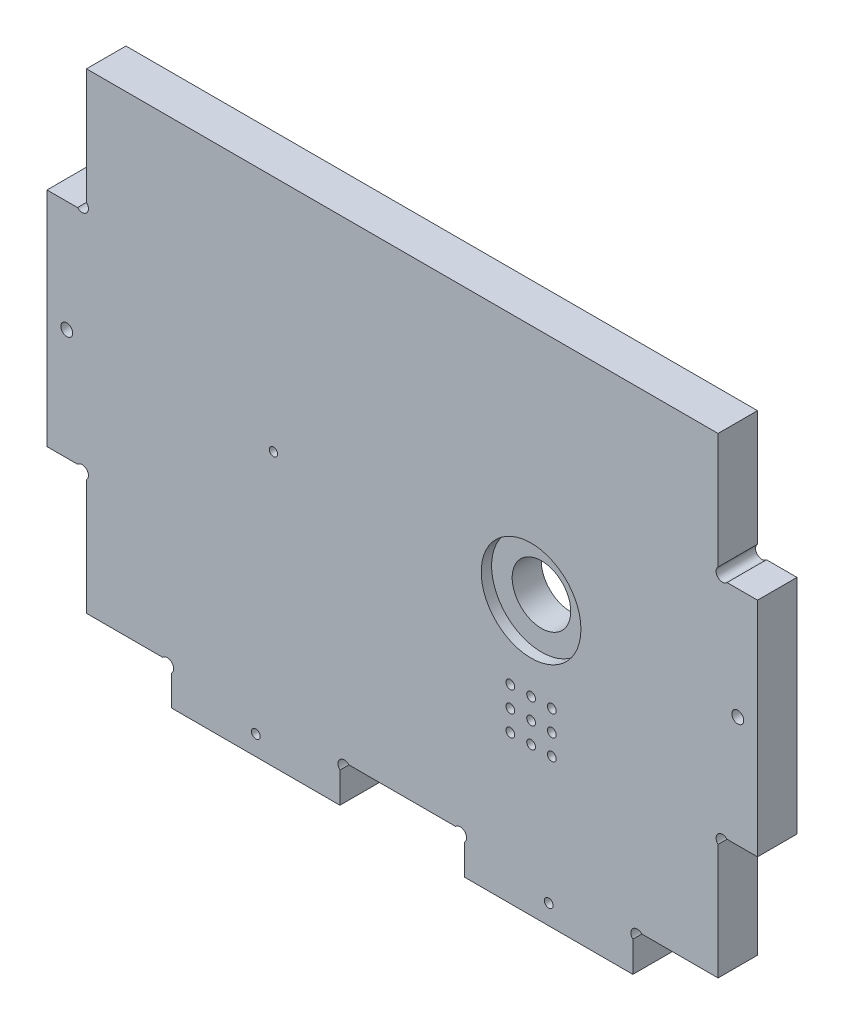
ISO-10303-21;
HEADER;
FILE_DESCRIPTION(('STEP AP214'),'2;1');
FILE_NAME('part.step','',(''),(''),'','','');
FILE_SCHEMA(('AUTOMOTIVE_DESIGN { 1 0 10303 214 1 1 1 1 }'));
ENDSEC;
DATA;
#1=APPLICATION_CONTEXT('core data for automotive mechanical design processes');
#2=APPLICATION_PROTOCOL_DEFINITION('international standard','automotive_design',2000,#1);
#3=PRODUCT_CONTEXT('',#1,'mechanical');
#4=PRODUCT('Part','Part','',(#3));
#5=PRODUCT_RELATED_PRODUCT_CATEGORY('part','',(#4));
#6=PRODUCT_DEFINITION_FORMATION('','',#4);
#7=PRODUCT_DEFINITION_CONTEXT('part definition',#1,'design');
#8=PRODUCT_DEFINITION('design','',#6,#7);
#9=PRODUCT_DEFINITION_SHAPE('','',#8);
#10=(LENGTH_UNIT() NAMED_UNIT(*) SI_UNIT(.MILLI.,.METRE.));
#11=(NAMED_UNIT(*) PLANE_ANGLE_UNIT() SI_UNIT($,.RADIAN.));
#12=(NAMED_UNIT(*) SI_UNIT($,.STERADIAN.) SOLID_ANGLE_UNIT());
#13=UNCERTAINTY_MEASURE_WITH_UNIT(LENGTH_MEASURE(1.E-05),#10,'distance_accuracy_value','');
#14=(GEOMETRIC_REPRESENTATION_CONTEXT(3) GLOBAL_UNCERTAINTY_ASSIGNED_CONTEXT((#13)) GLOBAL_UNIT_ASSIGNED_CONTEXT((#10,
#11,#12)) REPRESENTATION_CONTEXT('',''));
#15=CARTESIAN_POINT('',(0.,0.,0.));
#16=DIRECTION('',(0.,0.,1.));
#17=DIRECTION('',(1.,0.,0.));
#18=AXIS2_PLACEMENT_3D('',#15,#16,#17);
#19=CARTESIAN_POINT('',(62.,131.327177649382,0.));
#20=DIRECTION('',(0.,0.,1.));
#21=DIRECTION('',(1.,0.,0.));
#22=AXIS2_PLACEMENT_3D('',#19,#20,#21);
#23=CYLINDRICAL_SURFACE('',#22,14.1);
#24=CARTESIAN_POINT('',(62.,131.327177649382,0.));
#25=DIRECTION('',(0.,0.,1.));
#26=DIRECTION('',(1.,0.,0.));
#27=AXIS2_PLACEMENT_3D('',#24,#25,#26);
#28=CIRCLE('',#27,14.1);
#29=CARTESIAN_POINT('',(76.1,131.327177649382,0.));
#30=VERTEX_POINT('',#29);
#31=EDGE_CURVE('E542',#30,#30,#28,.T.);
#32=ORIENTED_EDGE('',*,*,#31,.F.);
#33=EDGE_LOOP('',(#32));
#34=FACE_BOUND('',#33,.T.);
#35=CARTESIAN_POINT('',(62.,131.327177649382,14.));
#36=DIRECTION('',(0.,0.,1.));
#37=DIRECTION('',(1.,0.,0.));
#38=AXIS2_PLACEMENT_3D('',#35,#36,#37);
#39=CIRCLE('',#38,14.1);
#40=CARTESIAN_POINT('',(76.1,131.327177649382,14.));
#41=VERTEX_POINT('',#40);
#42=EDGE_CURVE('E38',#41,#41,#39,.F.);
#43=ORIENTED_EDGE('',*,*,#42,.F.);
#44=EDGE_LOOP('',(#43));
#45=FACE_BOUND('',#44,.T.);
#46=ADVANCED_FACE('F34',(#34,#45),#23,.F.);
#47=CARTESIAN_POINT('',(113.1,16.9,19.));
#48=DIRECTION('',(0.,0.,1.));
#49=DIRECTION('',(1.,0.,0.));
#50=AXIS2_PLACEMENT_3D('',#47,#48,#49);
#51=PLANE('',#50);
#52=CARTESIAN_POINT('',(62.,131.327177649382,19.));
#53=DIRECTION('',(0.,0.,1.));
#54=DIRECTION('',(1.,0.,0.));
#55=AXIS2_PLACEMENT_3D('',#52,#53,#54);
#56=CIRCLE('',#55,24.);
#57=CARTESIAN_POINT('',(86.,131.327177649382,19.));
#58=VERTEX_POINT('',#57);
#59=EDGE_CURVE('E614',#58,#58,#56,.T.);
#60=ORIENTED_EDGE('',*,*,#59,.F.);
#61=EDGE_LOOP('',(#60));
#62=FACE_BOUND('',#61,.T.);
#63=CARTESIAN_POINT('',(62.,71.3271776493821,19.));
#64=DIRECTION('',(0.,0.,1.));
#65=DIRECTION('',(-1.,0.,0.));
#66=AXIS2_PLACEMENT_3D('',#63,#64,#65);
#67=CIRCLE('',#66,2.09999999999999);
#68=CARTESIAN_POINT('',(59.9,71.3271776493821,19.));
#69=VERTEX_POINT('',#68);
#70=EDGE_CURVE('E610',#69,#69,#67,.T.);
#71=ORIENTED_EDGE('',*,*,#70,.F.);
#72=EDGE_LOOP('',(#71));
#73=FACE_BOUND('',#72,.T.);
#74=CARTESIAN_POINT('',(52.0000000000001,71.3271776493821,19.));
#75=DIRECTION('',(0.,0.,1.));
#76=DIRECTION('',(1.,0.,0.));
#77=AXIS2_PLACEMENT_3D('',#74,#75,#76);
#78=CIRCLE('',#77,2.1);
#79=CARTESIAN_POINT('',(54.1000000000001,71.3271776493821,19.));
#80=VERTEX_POINT('',#79);
#81=EDGE_CURVE('E606',#80,#80,#78,.T.);
#82=ORIENTED_EDGE('',*,*,#81,.F.);
#83=EDGE_LOOP('',(#82));
#84=FACE_BOUND('',#83,.T.);
#85=CARTESIAN_POINT('',(72.,71.3271776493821,19.));
#86=DIRECTION('',(0.,0.,1.));
#87=DIRECTION('',(-1.,0.,0.));
#88=AXIS2_PLACEMENT_3D('',#85,#86,#87);
#89=CIRCLE('',#88,2.1);
#90=CARTESIAN_POINT('',(69.9,71.3271776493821,19.));
#91=VERTEX_POINT('',#90);
#92=EDGE_CURVE('E602',#91,#91,#89,.T.);
#93=ORIENTED_EDGE('',*,*,#92,.F.);
#94=EDGE_LOOP('',(#93));
#95=FACE_BOUND('',#94,.T.);
#96=CARTESIAN_POINT('',(52.,81.3271776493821,19.));
#97=DIRECTION('',(0.,0.,1.));
#98=DIRECTION('',(-1.,0.,0.));
#99=AXIS2_PLACEMENT_3D('',#96,#97,#98);
#100=CIRCLE('',#99,2.09999999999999);
#101=CARTESIAN_POINT('',(49.9000000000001,81.3271776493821,19.));
#102=VERTEX_POINT('',#101);
#103=EDGE_CURVE('E598',#102,#102,#100,.T.);
#104=ORIENTED_EDGE('',*,*,#103,.F.);
#105=EDGE_LOOP('',(#104));
#106=FACE_BOUND('',#105,.T.);
#107=CARTESIAN_POINT('',(72.,91.3271776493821,19.));
#108=DIRECTION('',(0.,0.,1.));
#109=DIRECTION('',(1.,0.,0.));
#110=AXIS2_PLACEMENT_3D('',#107,#108,#109);
#111=CIRCLE('',#110,2.1);
#112=CARTESIAN_POINT('',(74.1,91.3271776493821,19.));
#113=VERTEX_POINT('',#112);
#114=EDGE_CURVE('E594',#113,#113,#111,.T.);
#115=ORIENTED_EDGE('',*,*,#114,.F.);
#116=EDGE_LOOP('',(#115));
#117=FACE_BOUND('',#116,.T.);
#118=CARTESIAN_POINT('',(62.,91.3271776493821,19.));
#119=DIRECTION('',(0.,0.,1.));
#120=DIRECTION('',(1.,0.,0.));
#121=AXIS2_PLACEMENT_3D('',#118,#119,#120);
#122=CIRCLE('',#121,2.09999999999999);
#123=CARTESIAN_POINT('',(64.1,91.3271776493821,19.));
#124=VERTEX_POINT('',#123);
#125=EDGE_CURVE('E590',#124,#124,#122,.T.);
#126=ORIENTED_EDGE('',*,*,#125,.F.);
#127=EDGE_LOOP('',(#126));
#128=FACE_BOUND('',#127,.T.);
#129=CARTESIAN_POINT('',(72.0000000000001,81.3271776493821,19.));
#130=DIRECTION('',(0.,0.,1.));
#131=DIRECTION('',(1.,0.,0.));
#132=AXIS2_PLACEMENT_3D('',#129,#130,#131);
#133=CIRCLE('',#132,2.09999999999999);
#134=CARTESIAN_POINT('',(74.1,81.3271776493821,19.));
#135=VERTEX_POINT('',#134);
#136=EDGE_CURVE('E586',#135,#135,#133,.T.);
#137=ORIENTED_EDGE('',*,*,#136,.F.);
#138=EDGE_LOOP('',(#137));
#139=FACE_BOUND('',#138,.T.);
#140=CARTESIAN_POINT('',(52.0000000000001,91.3271776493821,19.));
#141=DIRECTION('',(0.,0.,1.));
#142=DIRECTION('',(-1.,0.,0.));
#143=AXIS2_PLACEMENT_3D('',#140,#141,#142);
#144=CIRCLE('',#143,2.1);
#145=CARTESIAN_POINT('',(49.9000000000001,91.3271776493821,19.));
#146=VERTEX_POINT('',#145);
#147=EDGE_CURVE('E582',#146,#146,#144,.T.);
#148=ORIENTED_EDGE('',*,*,#147,.F.);
#149=EDGE_LOOP('',(#148));
#150=FACE_BOUND('',#149,.T.);
#151=CARTESIAN_POINT('',(62.,81.3271776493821,19.));
#152=DIRECTION('',(0.,0.,1.));
#153=DIRECTION('',(1.,0.,0.));
#154=AXIS2_PLACEMENT_3D('',#151,#152,#153);
#155=CIRCLE('',#154,2.1);
#156=CARTESIAN_POINT('',(64.1000000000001,81.3271776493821,19.));
#157=VERTEX_POINT('',#156);
#158=EDGE_CURVE('E578',#157,#157,#155,.T.);
#159=ORIENTED_EDGE('',*,*,#158,.F.);
#160=EDGE_LOOP('',(#159));
#161=FACE_BOUND('',#160,.T.);
#162=CARTESIAN_POINT('',(-62.,131.327177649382,19.));
#163=DIRECTION('',(0.,0.,1.));
#164=DIRECTION('',(1.,0.,0.));
#165=AXIS2_PLACEMENT_3D('',#162,#163,#164);
#166=CIRCLE('',#165,2.);
#167=CARTESIAN_POINT('',(-60.,131.327177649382,19.));
#168=VERTEX_POINT('',#167);
#169=EDGE_CURVE('E574',#168,#168,#166,.T.);
#170=ORIENTED_EDGE('',*,*,#169,.F.);
#171=EDGE_LOOP('',(#170));
#172=FACE_BOUND('',#171,.T.);
#173=CARTESIAN_POINT('',(70.5,9.49999999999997,19.));
#174=DIRECTION('',(0.,0.,1.));
#175=DIRECTION('',(1.,0.,0.));
#176=AXIS2_PLACEMENT_3D('',#173,#174,#175);
#177=CIRCLE('',#176,2.1);
#178=CARTESIAN_POINT('',(72.6,9.49999999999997,19.));
#179=VERTEX_POINT('',#178);
#180=EDGE_CURVE('E562',#179,#179,#177,.T.);
#181=ORIENTED_EDGE('',*,*,#180,.F.);
#182=EDGE_LOOP('',(#181));
#183=FACE_BOUND('',#182,.T.);
#184=CARTESIAN_POINT('',(161.5,132.5,19.));
#185=DIRECTION('',(0.,0.,1.));
#186=DIRECTION('',(1.,0.,0.));
#187=AXIS2_PLACEMENT_3D('',#184,#185,#186);
#188=CIRCLE('',#187,2.86686344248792);
#189=CARTESIAN_POINT('',(164.366863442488,132.5,19.));
#190=VERTEX_POINT('',#189);
#191=EDGE_CURVE('E257',#190,#190,#188,.T.);
#192=ORIENTED_EDGE('',*,*,#191,.F.);
#193=EDGE_LOOP('',(#192));
#194=FACE_BOUND('',#193,.T.);
#195=DIRECTION('',(1.,0.,0.));
#196=VECTOR('',#195,1.);
#197=CARTESIAN_POINT('',(30.,0.,19.));
#198=LINE('',#197,#196);
#199=CARTESIAN_POINT('',(30.,0.,19.));
#200=VERTEX_POINT('',#199);
#201=CARTESIAN_POINT('',(111.,0.,19.));
#202=VERTEX_POINT('',#201);
#203=EDGE_CURVE('E308',#200,#202,#198,.T.);
#204=ORIENTED_EDGE('',*,*,#203,.T.);
#205=DIRECTION('',(0.,1.,0.));
#206=VECTOR('',#205,1.);
#207=CARTESIAN_POINT('',(111.,14.6881003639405,19.));
#208=LINE('',#207,#206);
#209=CARTESIAN_POINT('',(111.,14.6881003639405,19.));
#210=VERTEX_POINT('',#209);
#211=EDGE_CURVE('E155',#202,#210,#208,.T.);
#212=ORIENTED_EDGE('',*,*,#211,.T.);
#213=CARTESIAN_POINT('',(113.1,16.9,19.));
#214=DIRECTION('',(0.,0.,-1.));
#215=DIRECTION('',(1.,0.,0.));
#216=AXIS2_PLACEMENT_3D('',#213,#214,#215);
#217=CIRCLE('',#216,3.04999999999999);
#218=CARTESIAN_POINT('',(115.311899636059,19.,19.));
#219=VERTEX_POINT('',#218);
#220=EDGE_CURVE('E384',#210,#219,#217,.T.);
#221=ORIENTED_EDGE('',*,*,#220,.T.);
#222=DIRECTION('',(1.,0.,0.));
#223=VECTOR('',#222,1.);
#224=CARTESIAN_POINT('',(115.311899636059,19.,19.));
#225=LINE('',#224,#223);
#226=CARTESIAN_POINT('',(152.,19.,19.));
#227=VERTEX_POINT('',#226);
#228=EDGE_CURVE('E403',#219,#227,#225,.T.);
#229=ORIENTED_EDGE('',*,*,#228,.T.);
#230=DIRECTION('',(0.,1.,0.));
#231=VECTOR('',#230,1.);
#232=CARTESIAN_POINT('',(152.,74.6881003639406,19.));
#233=LINE('',#232,#231);
#234=CARTESIAN_POINT('',(152.,74.6881003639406,19.));
#235=VERTEX_POINT('',#234);
#236=EDGE_CURVE('E400',#227,#235,#233,.T.);
#237=ORIENTED_EDGE('',*,*,#236,.T.);
#238=CARTESIAN_POINT('',(154.1,76.9,19.));
#239=DIRECTION('',(0.,0.,-1.));
#240=DIRECTION('',(1.,0.,0.));
#241=AXIS2_PLACEMENT_3D('',#238,#239,#240);
#242=CIRCLE('',#241,3.04999999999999);
#243=CARTESIAN_POINT('',(156.311899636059,79.,19.));
#244=VERTEX_POINT('',#243);
#245=EDGE_CURVE('E402',#235,#244,#242,.T.);
#246=ORIENTED_EDGE('',*,*,#245,.T.);
#247=DIRECTION('',(1.,0.,0.));
#248=VECTOR('',#247,1.);
#249=CARTESIAN_POINT('',(171.,79.,19.));
#250=LINE('',#249,#248);
#251=CARTESIAN_POINT('',(171.,79.,19.));
#252=VERTEX_POINT('',#251);
#253=EDGE_CURVE('E405',#244,#252,#250,.T.);
#254=ORIENTED_EDGE('',*,*,#253,.T.);
#255=DIRECTION('',(0.,1.,0.));
#256=VECTOR('',#255,1.);
#257=CARTESIAN_POINT('',(171.,79.,19.));
#258=LINE('',#257,#256);
#259=CARTESIAN_POINT('',(171.,186.,19.));
#260=VERTEX_POINT('',#259);
#261=EDGE_CURVE('E411',#252,#260,#258,.T.);
#262=ORIENTED_EDGE('',*,*,#261,.T.);
#263=DIRECTION('',(-1.,0.,0.));
#264=VECTOR('',#263,1.);
#265=CARTESIAN_POINT('',(156.311899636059,186.,19.));
#266=LINE('',#265,#264);
#267=CARTESIAN_POINT('',(156.311899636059,186.,19.));
#268=VERTEX_POINT('',#267);
#269=EDGE_CURVE('E413',#260,#268,#266,.T.);
#270=ORIENTED_EDGE('',*,*,#269,.T.);
#271=CARTESIAN_POINT('',(154.1,188.1,19.));
#272=DIRECTION('',(0.,0.,-1.));
#273=DIRECTION('',(1.,0.,0.));
#274=AXIS2_PLACEMENT_3D('',#271,#272,#273);
#275=CIRCLE('',#274,3.05);
#276=CARTESIAN_POINT('',(152.,190.311899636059,19.));
#277=VERTEX_POINT('',#276);
#278=EDGE_CURVE('E415',#268,#277,#275,.T.);
#279=ORIENTED_EDGE('',*,*,#278,.T.);
#280=DIRECTION('',(0.,1.,0.));
#281=VECTOR('',#280,1.);
#282=CARTESIAN_POINT('',(152.,246.,19.));
#283=LINE('',#282,#281);
#284=CARTESIAN_POINT('',(152.,246.,19.));
#285=VERTEX_POINT('',#284);
#286=EDGE_CURVE('E417',#277,#285,#283,.T.);
#287=ORIENTED_EDGE('',*,*,#286,.T.);
#288=DIRECTION('',(-1.,0.,0.));
#289=VECTOR('',#288,1.);
#290=CARTESIAN_POINT('',(-152.,246.,19.));
#291=LINE('',#290,#289);
#292=CARTESIAN_POINT('',(-152.,246.,19.));
#293=VERTEX_POINT('',#292);
#294=EDGE_CURVE('E419',#285,#293,#291,.T.);
#295=ORIENTED_EDGE('',*,*,#294,.T.);
#296=DIRECTION('',(0.,-1.,0.));
#297=VECTOR('',#296,1.);
#298=CARTESIAN_POINT('',(-152.,246.,19.));
#299=LINE('',#298,#297);
#300=CARTESIAN_POINT('',(-152.,190.311899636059,19.));
#301=VERTEX_POINT('',#300);
#302=EDGE_CURVE('E421',#293,#301,#299,.T.);
#303=ORIENTED_EDGE('',*,*,#302,.T.);
#304=CARTESIAN_POINT('',(-154.1,188.1,19.));
#305=DIRECTION('',(0.,0.,-1.));
#306=DIRECTION('',(-1.,0.,0.));
#307=AXIS2_PLACEMENT_3D('',#304,#305,#306);
#308=CIRCLE('',#307,3.05);
#309=CARTESIAN_POINT('',(-156.311899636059,186.,19.));
#310=VERTEX_POINT('',#309);
#311=EDGE_CURVE('E423',#301,#310,#308,.T.);
#312=ORIENTED_EDGE('',*,*,#311,.T.);
#313=DIRECTION('',(-1.,0.,0.));
#314=VECTOR('',#313,1.);
#315=CARTESIAN_POINT('',(-156.311899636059,186.,19.));
#316=LINE('',#315,#314);
#317=CARTESIAN_POINT('',(-171.,186.,19.));
#318=VERTEX_POINT('',#317);
#319=EDGE_CURVE('E425',#310,#318,#316,.T.);
#320=ORIENTED_EDGE('',*,*,#319,.T.);
#321=DIRECTION('',(0.,-1.,0.));
#322=VECTOR('',#321,1.);
#323=CARTESIAN_POINT('',(-171.,186.,19.));
#324=LINE('',#323,#322);
#325=CARTESIAN_POINT('',(-171.,79.,19.));
#326=VERTEX_POINT('',#325);
#327=EDGE_CURVE('E427',#318,#326,#324,.T.);
#328=ORIENTED_EDGE('',*,*,#327,.T.);
#329=DIRECTION('',(1.,0.,0.));
#330=VECTOR('',#329,1.);
#331=CARTESIAN_POINT('',(-171.,79.,19.));
#332=LINE('',#331,#330);
#333=CARTESIAN_POINT('',(-156.311899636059,79.,19.));
#334=VERTEX_POINT('',#333);
#335=EDGE_CURVE('E429',#326,#334,#332,.T.);
#336=ORIENTED_EDGE('',*,*,#335,.T.);
#337=CARTESIAN_POINT('',(-154.1,76.9,19.));
#338=DIRECTION('',(0.,0.,-1.));
#339=DIRECTION('',(-1.,0.,0.));
#340=AXIS2_PLACEMENT_3D('',#337,#338,#339);
#341=CIRCLE('',#340,3.04999999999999);
#342=CARTESIAN_POINT('',(-152.,74.6881003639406,19.));
#343=VERTEX_POINT('',#342);
#344=EDGE_CURVE('E431',#334,#343,#341,.T.);
#345=ORIENTED_EDGE('',*,*,#344,.T.);
#346=DIRECTION('',(0.,-1.,0.));
#347=VECTOR('',#346,1.);
#348=CARTESIAN_POINT('',(-152.,74.6881003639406,19.));
#349=LINE('',#348,#347);
#350=CARTESIAN_POINT('',(-152.,19.,19.));
#351=VERTEX_POINT('',#350);
#352=EDGE_CURVE('E433',#343,#351,#349,.T.);
#353=ORIENTED_EDGE('',*,*,#352,.T.);
#354=DIRECTION('',(1.,0.,0.));
#355=VECTOR('',#354,1.);
#356=CARTESIAN_POINT('',(-115.311899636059,19.,19.));
#357=LINE('',#356,#355);
#358=CARTESIAN_POINT('',(-115.311899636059,19.,19.));
#359=VERTEX_POINT('',#358);
#360=EDGE_CURVE('E435',#351,#359,#357,.T.);
#361=ORIENTED_EDGE('',*,*,#360,.T.);
#362=CARTESIAN_POINT('',(-113.1,16.9,19.));
#363=DIRECTION('',(0.,0.,-1.));
#364=DIRECTION('',(-1.,0.,0.));
#365=AXIS2_PLACEMENT_3D('',#362,#363,#364);
#366=CIRCLE('',#365,3.04999999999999);
#367=CARTESIAN_POINT('',(-111.,14.6881003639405,19.));
#368=VERTEX_POINT('',#367);
#369=EDGE_CURVE('E437',#359,#368,#366,.T.);
#370=ORIENTED_EDGE('',*,*,#369,.T.);
#371=DIRECTION('',(0.,-1.,0.));
#372=VECTOR('',#371,1.);
#373=CARTESIAN_POINT('',(-111.,14.6881003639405,19.));
#374=LINE('',#373,#372);
#375=CARTESIAN_POINT('',(-111.,0.,19.));
#376=VERTEX_POINT('',#375);
#377=EDGE_CURVE('E439',#368,#376,#374,.T.);
#378=ORIENTED_EDGE('',*,*,#377,.T.);
#379=DIRECTION('',(1.,0.,0.));
#380=VECTOR('',#379,1.);
#381=CARTESIAN_POINT('',(-30.,0.,19.));
#382=LINE('',#381,#380);
#383=CARTESIAN_POINT('',(-30.,0.,19.));
#384=VERTEX_POINT('',#383);
#385=EDGE_CURVE('E441',#376,#384,#382,.T.);
#386=ORIENTED_EDGE('',*,*,#385,.T.);
#387=DIRECTION('',(0.,1.,0.));
#388=VECTOR('',#387,1.);
#389=CARTESIAN_POINT('',(-30.,0.,19.));
#390=LINE('',#389,#388);
#391=CARTESIAN_POINT('',(-30.,14.6881003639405,19.));
#392=VERTEX_POINT('',#391);
#393=EDGE_CURVE('E443',#384,#392,#390,.T.);
#394=ORIENTED_EDGE('',*,*,#393,.T.);
#395=CARTESIAN_POINT('',(-27.9,16.9,19.));
#396=DIRECTION('',(0.,0.,-1.));
#397=DIRECTION('',(-1.,0.,0.));
#398=AXIS2_PLACEMENT_3D('',#395,#396,#397);
#399=CIRCLE('',#398,3.05);
#400=CARTESIAN_POINT('',(-25.6881003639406,19.,19.));
#401=VERTEX_POINT('',#400);
#402=EDGE_CURVE('E235',#392,#401,#399,.T.);
#403=ORIENTED_EDGE('',*,*,#402,.T.);
#404=DIRECTION('',(1.,0.,0.));
#405=VECTOR('',#404,1.);
#406=CARTESIAN_POINT('',(25.6881003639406,19.,19.));
#407=LINE('',#406,#405);
#408=CARTESIAN_POINT('',(25.6881003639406,19.,19.));
#409=VERTEX_POINT('',#408);
#410=EDGE_CURVE('E228',#401,#409,#407,.T.);
#411=ORIENTED_EDGE('',*,*,#410,.T.);
#412=CARTESIAN_POINT('',(27.9,16.9,19.));
#413=DIRECTION('',(0.,0.,-1.));
#414=DIRECTION('',(1.,0.,0.));
#415=AXIS2_PLACEMENT_3D('',#412,#413,#414);
#416=CIRCLE('',#415,3.05);
#417=CARTESIAN_POINT('',(30.,14.6881003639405,19.));
#418=VERTEX_POINT('',#417);
#419=EDGE_CURVE('E233',#409,#418,#416,.T.);
#420=ORIENTED_EDGE('',*,*,#419,.T.);
#421=DIRECTION('',(0.,-1.,0.));
#422=VECTOR('',#421,1.);
#423=CARTESIAN_POINT('',(30.,0.,19.));
#424=LINE('',#423,#422);
#425=EDGE_CURVE('E52',#418,#200,#424,.T.);
#426=ORIENTED_EDGE('',*,*,#425,.T.);
#427=EDGE_LOOP('',(#204,#212,#221,#229,#237,#246,#254,#262,#270,#279,#287,#295,#303,#312,#320,
#328,#336,#345,#353,#361,#370,#378,#386,#394,#403,#411,#420,#426));
#428=FACE_BOUND('',#427,.T.);
#429=CARTESIAN_POINT('',(-161.5,132.5,19.));
#430=DIRECTION('',(0.,0.,1.));
#431=DIRECTION('',(-1.,0.,0.));
#432=AXIS2_PLACEMENT_3D('',#429,#430,#431);
#433=CIRCLE('',#432,2.86686344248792);
#434=CARTESIAN_POINT('',(-164.366863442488,132.5,19.));
#435=VERTEX_POINT('',#434);
#436=EDGE_CURVE('E551',#435,#435,#433,.T.);
#437=ORIENTED_EDGE('',*,*,#436,.F.);
#438=EDGE_LOOP('',(#437));
#439=FACE_BOUND('',#438,.T.);
#440=CARTESIAN_POINT('',(-70.5,9.49999999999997,19.));
#441=DIRECTION('',(0.,0.,1.));
#442=DIRECTION('',(-1.,0.,0.));
#443=AXIS2_PLACEMENT_3D('',#440,#441,#442);
#444=CIRCLE('',#443,2.1);
#445=CARTESIAN_POINT('',(-72.6,9.49999999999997,19.));
#446=VERTEX_POINT('',#445);
#447=EDGE_CURVE('E565',#446,#446,#444,.T.);
#448=ORIENTED_EDGE('',*,*,#447,.F.);
#449=EDGE_LOOP('',(#448));
#450=FACE_BOUND('',#449,.T.);
#451=ADVANCED_FACE('F230',(#62,#73,#84,#95,#106,#117,#128,#139,#150,#161,#172,#183,#194,#428,
#439,#450),#51,.T.);
#452=CARTESIAN_POINT('',(113.1,16.9,0.));
#453=DIRECTION('',(0.,0.,1.));
#454=DIRECTION('',(1.,0.,0.));
#455=AXIS2_PLACEMENT_3D('',#452,#453,#454);
#456=PLANE('',#455);
#457=CARTESIAN_POINT('',(62.,71.3271776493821,0.));
#458=DIRECTION('',(0.,0.,1.));
#459=DIRECTION('',(-1.,0.,0.));
#460=AXIS2_PLACEMENT_3D('',#457,#458,#459);
#461=CIRCLE('',#460,2.09999999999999);
#462=CARTESIAN_POINT('',(59.9,71.3271776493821,0.));
#463=VERTEX_POINT('',#462);
#464=EDGE_CURVE('E503',#463,#463,#461,.T.);
#465=ORIENTED_EDGE('',*,*,#464,.T.);
#466=EDGE_LOOP('',(#465));
#467=FACE_BOUND('',#466,.T.);
#468=CARTESIAN_POINT('',(52.0000000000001,71.3271776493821,0.));
#469=DIRECTION('',(0.,0.,1.));
#470=DIRECTION('',(1.,0.,0.));
#471=AXIS2_PLACEMENT_3D('',#468,#469,#470);
#472=CIRCLE('',#471,2.1);
#473=CARTESIAN_POINT('',(54.1000000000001,71.3271776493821,0.));
#474=VERTEX_POINT('',#473);
#475=EDGE_CURVE('E507',#474,#474,#472,.T.);
#476=ORIENTED_EDGE('',*,*,#475,.T.);
#477=EDGE_LOOP('',(#476));
#478=FACE_BOUND('',#477,.T.);
#479=CARTESIAN_POINT('',(72.,71.3271776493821,0.));
#480=DIRECTION('',(0.,0.,1.));
#481=DIRECTION('',(-1.,0.,0.));
#482=AXIS2_PLACEMENT_3D('',#479,#480,#481);
#483=CIRCLE('',#482,2.1);
#484=CARTESIAN_POINT('',(69.9,71.3271776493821,0.));
#485=VERTEX_POINT('',#484);
#486=EDGE_CURVE('E511',#485,#485,#483,.T.);
#487=ORIENTED_EDGE('',*,*,#486,.T.);
#488=EDGE_LOOP('',(#487));
#489=FACE_BOUND('',#488,.T.);
#490=CARTESIAN_POINT('',(52.,81.3271776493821,0.));
#491=DIRECTION('',(0.,0.,1.));
#492=DIRECTION('',(-1.,0.,0.));
#493=AXIS2_PLACEMENT_3D('',#490,#491,#492);
#494=CIRCLE('',#493,2.09999999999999);
#495=CARTESIAN_POINT('',(49.9000000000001,81.3271776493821,0.));
#496=VERTEX_POINT('',#495);
#497=EDGE_CURVE('E515',#496,#496,#494,.T.);
#498=ORIENTED_EDGE('',*,*,#497,.T.);
#499=EDGE_LOOP('',(#498));
#500=FACE_BOUND('',#499,.T.);
#501=CARTESIAN_POINT('',(72.,91.3271776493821,0.));
#502=DIRECTION('',(0.,0.,1.));
#503=DIRECTION('',(1.,0.,0.));
#504=AXIS2_PLACEMENT_3D('',#501,#502,#503);
#505=CIRCLE('',#504,2.1);
#506=CARTESIAN_POINT('',(74.1,91.3271776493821,0.));
#507=VERTEX_POINT('',#506);
#508=EDGE_CURVE('E519',#507,#507,#505,.T.);
#509=ORIENTED_EDGE('',*,*,#508,.T.);
#510=EDGE_LOOP('',(#509));
#511=FACE_BOUND('',#510,.T.);
#512=CARTESIAN_POINT('',(62.,91.3271776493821,0.));
#513=DIRECTION('',(0.,0.,1.));
#514=DIRECTION('',(1.,0.,0.));
#515=AXIS2_PLACEMENT_3D('',#512,#513,#514);
#516=CIRCLE('',#515,2.09999999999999);
#517=CARTESIAN_POINT('',(64.1,91.3271776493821,0.));
#518=VERTEX_POINT('',#517);
#519=EDGE_CURVE('E523',#518,#518,#516,.T.);
#520=ORIENTED_EDGE('',*,*,#519,.T.);
#521=EDGE_LOOP('',(#520));
#522=FACE_BOUND('',#521,.T.);
#523=CARTESIAN_POINT('',(72.0000000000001,81.3271776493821,0.));
#524=DIRECTION('',(0.,0.,1.));
#525=DIRECTION('',(1.,0.,0.));
#526=AXIS2_PLACEMENT_3D('',#523,#524,#525);
#527=CIRCLE('',#526,2.09999999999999);
#528=CARTESIAN_POINT('',(74.1,81.3271776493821,0.));
#529=VERTEX_POINT('',#528);
#530=EDGE_CURVE('E527',#529,#529,#527,.T.);
#531=ORIENTED_EDGE('',*,*,#530,.T.);
#532=EDGE_LOOP('',(#531));
#533=FACE_BOUND('',#532,.T.);
#534=CARTESIAN_POINT('',(52.0000000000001,91.3271776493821,0.));
#535=DIRECTION('',(0.,0.,1.));
#536=DIRECTION('',(-1.,0.,0.));
#537=AXIS2_PLACEMENT_3D('',#534,#535,#536);
#538=CIRCLE('',#537,2.1);
#539=CARTESIAN_POINT('',(49.9000000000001,91.3271776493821,0.));
#540=VERTEX_POINT('',#539);
#541=EDGE_CURVE('E531',#540,#540,#538,.T.);
#542=ORIENTED_EDGE('',*,*,#541,.T.);
#543=EDGE_LOOP('',(#542));
#544=FACE_BOUND('',#543,.T.);
#545=CARTESIAN_POINT('',(62.,81.3271776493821,0.));
#546=DIRECTION('',(0.,0.,1.));
#547=DIRECTION('',(1.,0.,0.));
#548=AXIS2_PLACEMENT_3D('',#545,#546,#547);
#549=CIRCLE('',#548,2.1);
#550=CARTESIAN_POINT('',(64.1000000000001,81.3271776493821,0.));
#551=VERTEX_POINT('',#550);
#552=EDGE_CURVE('E535',#551,#551,#549,.T.);
#553=ORIENTED_EDGE('',*,*,#552,.T.);
#554=EDGE_LOOP('',(#553));
#555=FACE_BOUND('',#554,.T.);
#556=CARTESIAN_POINT('',(-62.,131.327177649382,0.));
#557=DIRECTION('',(0.,0.,1.));
#558=DIRECTION('',(1.,0.,0.));
#559=AXIS2_PLACEMENT_3D('',#556,#557,#558);
#560=CIRCLE('',#559,2.);
#561=CARTESIAN_POINT('',(-60.,131.327177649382,0.));
#562=VERTEX_POINT('',#561);
#563=EDGE_CURVE('E539',#562,#562,#560,.T.);
#564=ORIENTED_EDGE('',*,*,#563,.T.);
#565=EDGE_LOOP('',(#564));
#566=FACE_BOUND('',#565,.T.);
#567=ORIENTED_EDGE('',*,*,#31,.T.);
#568=EDGE_LOOP('',(#567));
#569=FACE_BOUND('',#568,.T.);
#570=CARTESIAN_POINT('',(70.5,9.49999999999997,0.));
#571=DIRECTION('',(0.,0.,1.));
#572=DIRECTION('',(1.,0.,0.));
#573=AXIS2_PLACEMENT_3D('',#570,#571,#572);
#574=CIRCLE('',#573,2.1);
#575=CARTESIAN_POINT('',(72.6,9.49999999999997,0.));
#576=VERTEX_POINT('',#575);
#577=EDGE_CURVE('E546',#576,#576,#574,.T.);
#578=ORIENTED_EDGE('',*,*,#577,.T.);
#579=EDGE_LOOP('',(#578));
#580=FACE_BOUND('',#579,.T.);
#581=CARTESIAN_POINT('',(161.5,132.5,0.));
#582=DIRECTION('',(0.,0.,1.));
#583=DIRECTION('',(1.,0.,0.));
#584=AXIS2_PLACEMENT_3D('',#581,#582,#583);
#585=CIRCLE('',#584,2.86686344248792);
#586=CARTESIAN_POINT('',(164.366863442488,132.5,0.));
#587=VERTEX_POINT('',#586);
#588=EDGE_CURVE('E549',#587,#587,#585,.T.);
#589=ORIENTED_EDGE('',*,*,#588,.T.);
#590=EDGE_LOOP('',(#589));
#591=FACE_BOUND('',#590,.T.);
#592=DIRECTION('',(1.,0.,0.));
#593=VECTOR('',#592,1.);
#594=CARTESIAN_POINT('',(30.,0.,0.));
#595=LINE('',#594,#593);
#596=CARTESIAN_POINT('',(30.,0.,0.));
#597=VERTEX_POINT('',#596);
#598=CARTESIAN_POINT('',(111.,0.,0.));
#599=VERTEX_POINT('',#598);
#600=EDGE_CURVE('E253',#597,#599,#595,.T.);
#601=ORIENTED_EDGE('',*,*,#600,.F.);
#602=DIRECTION('',(0.,-1.,0.));
#603=VECTOR('',#602,1.);
#604=CARTESIAN_POINT('',(30.,0.,0.));
#605=LINE('',#604,#603);
#606=CARTESIAN_POINT('',(30.,14.6881003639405,0.));
#607=VERTEX_POINT('',#606);
#608=EDGE_CURVE('E147',#607,#597,#605,.T.);
#609=ORIENTED_EDGE('',*,*,#608,.F.);
#610=CARTESIAN_POINT('',(27.9,16.9,0.));
#611=DIRECTION('',(0.,0.,-1.));
#612=DIRECTION('',(1.,0.,0.));
#613=AXIS2_PLACEMENT_3D('',#610,#611,#612);
#614=CIRCLE('',#613,3.05);
#615=CARTESIAN_POINT('',(25.6881003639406,19.,0.));
#616=VERTEX_POINT('',#615);
#617=EDGE_CURVE('E141',#616,#607,#614,.T.);
#618=ORIENTED_EDGE('',*,*,#617,.F.);
#619=DIRECTION('',(1.,0.,0.));
#620=VECTOR('',#619,1.);
#621=CARTESIAN_POINT('',(25.6881003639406,19.,0.));
#622=LINE('',#621,#620);
#623=CARTESIAN_POINT('',(-25.6881003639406,19.,0.));
#624=VERTEX_POINT('',#623);
#625=EDGE_CURVE('E243',#624,#616,#622,.T.);
#626=ORIENTED_EDGE('',*,*,#625,.F.);
#627=CARTESIAN_POINT('',(-27.9,16.9,0.));
#628=DIRECTION('',(0.,0.,-1.));
#629=DIRECTION('',(-1.,0.,0.));
#630=AXIS2_PLACEMENT_3D('',#627,#628,#629);
#631=CIRCLE('',#630,3.05);
#632=CARTESIAN_POINT('',(-30.,14.6881003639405,0.));
#633=VERTEX_POINT('',#632);
#634=EDGE_CURVE('E303',#633,#624,#631,.T.);
#635=ORIENTED_EDGE('',*,*,#634,.F.);
#636=DIRECTION('',(0.,1.,0.));
#637=VECTOR('',#636,1.);
#638=CARTESIAN_POINT('',(-30.,0.,0.));
#639=LINE('',#638,#637);
#640=CARTESIAN_POINT('',(-30.,0.,0.));
#641=VERTEX_POINT('',#640);
#642=EDGE_CURVE('E301',#641,#633,#639,.T.);
#643=ORIENTED_EDGE('',*,*,#642,.F.);
#644=DIRECTION('',(1.,0.,0.));
#645=VECTOR('',#644,1.);
#646=CARTESIAN_POINT('',(-30.,0.,0.));
#647=LINE('',#646,#645);
#648=CARTESIAN_POINT('',(-111.,0.,0.));
#649=VERTEX_POINT('',#648);
#650=EDGE_CURVE('E299',#649,#641,#647,.T.);
#651=ORIENTED_EDGE('',*,*,#650,.F.);
#652=DIRECTION('',(0.,-1.,0.));
#653=VECTOR('',#652,1.);
#654=CARTESIAN_POINT('',(-111.,14.6881003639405,0.));
#655=LINE('',#654,#653);
#656=CARTESIAN_POINT('',(-111.,14.6881003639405,0.));
#657=VERTEX_POINT('',#656);
#658=EDGE_CURVE('E297',#657,#649,#655,.T.);
#659=ORIENTED_EDGE('',*,*,#658,.F.);
#660=CARTESIAN_POINT('',(-113.1,16.9,0.));
#661=DIRECTION('',(0.,0.,-1.));
#662=DIRECTION('',(-1.,0.,0.));
#663=AXIS2_PLACEMENT_3D('',#660,#661,#662);
#664=CIRCLE('',#663,3.04999999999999);
#665=CARTESIAN_POINT('',(-115.311899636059,19.,0.));
#666=VERTEX_POINT('',#665);
#667=EDGE_CURVE('E295',#666,#657,#664,.T.);
#668=ORIENTED_EDGE('',*,*,#667,.F.);
#669=DIRECTION('',(1.,0.,0.));
#670=VECTOR('',#669,1.);
#671=CARTESIAN_POINT('',(-115.311899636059,19.,0.));
#672=LINE('',#671,#670);
#673=CARTESIAN_POINT('',(-152.,19.,0.));
#674=VERTEX_POINT('',#673);
#675=EDGE_CURVE('E293',#674,#666,#672,.T.);
#676=ORIENTED_EDGE('',*,*,#675,.F.);
#677=DIRECTION('',(0.,-1.,0.));
#678=VECTOR('',#677,1.);
#679=CARTESIAN_POINT('',(-152.,74.6881003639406,0.));
#680=LINE('',#679,#678);
#681=CARTESIAN_POINT('',(-152.,74.6881003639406,0.));
#682=VERTEX_POINT('',#681);
#683=EDGE_CURVE('E291',#682,#674,#680,.T.);
#684=ORIENTED_EDGE('',*,*,#683,.F.);
#685=CARTESIAN_POINT('',(-154.1,76.9,0.));
#686=DIRECTION('',(0.,0.,-1.));
#687=DIRECTION('',(-1.,0.,0.));
#688=AXIS2_PLACEMENT_3D('',#685,#686,#687);
#689=CIRCLE('',#688,3.04999999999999);
#690=CARTESIAN_POINT('',(-156.311899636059,79.,0.));
#691=VERTEX_POINT('',#690);
#692=EDGE_CURVE('E289',#691,#682,#689,.T.);
#693=ORIENTED_EDGE('',*,*,#692,.F.);
#694=DIRECTION('',(1.,0.,0.));
#695=VECTOR('',#694,1.);
#696=CARTESIAN_POINT('',(-171.,79.,0.));
#697=LINE('',#696,#695);
#698=CARTESIAN_POINT('',(-171.,79.,0.));
#699=VERTEX_POINT('',#698);
#700=EDGE_CURVE('E287',#699,#691,#697,.T.);
#701=ORIENTED_EDGE('',*,*,#700,.F.);
#702=DIRECTION('',(0.,-1.,0.));
#703=VECTOR('',#702,1.);
#704=CARTESIAN_POINT('',(-171.,186.,0.));
#705=LINE('',#704,#703);
#706=CARTESIAN_POINT('',(-171.,186.,0.));
#707=VERTEX_POINT('',#706);
#708=EDGE_CURVE('E285',#707,#699,#705,.T.);
#709=ORIENTED_EDGE('',*,*,#708,.F.);
#710=DIRECTION('',(-1.,0.,0.));
#711=VECTOR('',#710,1.);
#712=CARTESIAN_POINT('',(-156.311899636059,186.,0.));
#713=LINE('',#712,#711);
#714=CARTESIAN_POINT('',(-156.311899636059,186.,0.));
#715=VERTEX_POINT('',#714);
#716=EDGE_CURVE('E283',#715,#707,#713,.T.);
#717=ORIENTED_EDGE('',*,*,#716,.F.);
#718=CARTESIAN_POINT('',(-154.1,188.1,0.));
#719=DIRECTION('',(0.,0.,-1.));
#720=DIRECTION('',(-1.,0.,0.));
#721=AXIS2_PLACEMENT_3D('',#718,#719,#720);
#722=CIRCLE('',#721,3.05);
#723=CARTESIAN_POINT('',(-152.,190.311899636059,0.));
#724=VERTEX_POINT('',#723);
#725=EDGE_CURVE('E281',#724,#715,#722,.T.);
#726=ORIENTED_EDGE('',*,*,#725,.F.);
#727=DIRECTION('',(0.,-1.,0.));
#728=VECTOR('',#727,1.);
#729=CARTESIAN_POINT('',(-152.,246.,0.));
#730=LINE('',#729,#728);
#731=CARTESIAN_POINT('',(-152.,246.,0.));
#732=VERTEX_POINT('',#731);
#733=EDGE_CURVE('E279',#732,#724,#730,.T.);
#734=ORIENTED_EDGE('',*,*,#733,.F.);
#735=DIRECTION('',(-1.,0.,0.));
#736=VECTOR('',#735,1.);
#737=CARTESIAN_POINT('',(-152.,246.,0.));
#738=LINE('',#737,#736);
#739=CARTESIAN_POINT('',(152.,246.,0.));
#740=VERTEX_POINT('',#739);
#741=EDGE_CURVE('E277',#740,#732,#738,.T.);
#742=ORIENTED_EDGE('',*,*,#741,.F.);
#743=DIRECTION('',(0.,1.,0.));
#744=VECTOR('',#743,1.);
#745=CARTESIAN_POINT('',(152.,246.,0.));
#746=LINE('',#745,#744);
#747=CARTESIAN_POINT('',(152.,190.311899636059,0.));
#748=VERTEX_POINT('',#747);
#749=EDGE_CURVE('E275',#748,#740,#746,.T.);
#750=ORIENTED_EDGE('',*,*,#749,.F.);
#751=CARTESIAN_POINT('',(154.1,188.1,0.));
#752=DIRECTION('',(0.,0.,-1.));
#753=DIRECTION('',(1.,0.,0.));
#754=AXIS2_PLACEMENT_3D('',#751,#752,#753);
#755=CIRCLE('',#754,3.05);
#756=CARTESIAN_POINT('',(156.311899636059,186.,0.));
#757=VERTEX_POINT('',#756);
#758=EDGE_CURVE('E273',#757,#748,#755,.T.);
#759=ORIENTED_EDGE('',*,*,#758,.F.);
#760=DIRECTION('',(-1.,0.,0.));
#761=VECTOR('',#760,1.);
#762=CARTESIAN_POINT('',(156.311899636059,186.,0.));
#763=LINE('',#762,#761);
#764=CARTESIAN_POINT('',(171.,186.,0.));
#765=VERTEX_POINT('',#764);
#766=EDGE_CURVE('E271',#765,#757,#763,.T.);
#767=ORIENTED_EDGE('',*,*,#766,.F.);
#768=DIRECTION('',(0.,1.,0.));
#769=VECTOR('',#768,1.);
#770=CARTESIAN_POINT('',(171.,79.,0.));
#771=LINE('',#770,#769);
#772=CARTESIAN_POINT('',(171.,79.,0.));
#773=VERTEX_POINT('',#772);
#774=EDGE_CURVE('E269',#773,#765,#771,.T.);
#775=ORIENTED_EDGE('',*,*,#774,.F.);
#776=DIRECTION('',(1.,0.,0.));
#777=VECTOR('',#776,1.);
#778=CARTESIAN_POINT('',(171.,79.,0.));
#779=LINE('',#778,#777);
#780=CARTESIAN_POINT('',(156.311899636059,79.,0.));
#781=VERTEX_POINT('',#780);
#782=EDGE_CURVE('E267',#781,#773,#779,.T.);
#783=ORIENTED_EDGE('',*,*,#782,.F.);
#784=CARTESIAN_POINT('',(154.1,76.9,0.));
#785=DIRECTION('',(0.,0.,-1.));
#786=DIRECTION('',(1.,0.,0.));
#787=AXIS2_PLACEMENT_3D('',#784,#785,#786);
#788=CIRCLE('',#787,3.04999999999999);
#789=CARTESIAN_POINT('',(152.,74.6881003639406,0.));
#790=VERTEX_POINT('',#789);
#791=EDGE_CURVE('E265',#790,#781,#788,.T.);
#792=ORIENTED_EDGE('',*,*,#791,.F.);
#793=DIRECTION('',(0.,1.,0.));
#794=VECTOR('',#793,1.);
#795=CARTESIAN_POINT('',(152.,74.6881003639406,0.));
#796=LINE('',#795,#794);
#797=CARTESIAN_POINT('',(152.,19.,0.));
#798=VERTEX_POINT('',#797);
#799=EDGE_CURVE('E263',#798,#790,#796,.T.);
#800=ORIENTED_EDGE('',*,*,#799,.F.);
#801=DIRECTION('',(1.,0.,0.));
#802=VECTOR('',#801,1.);
#803=CARTESIAN_POINT('',(115.311899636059,19.,0.));
#804=LINE('',#803,#802);
#805=CARTESIAN_POINT('',(115.311899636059,19.,0.));
#806=VERTEX_POINT('',#805);
#807=EDGE_CURVE('E261',#806,#798,#804,.T.);
#808=ORIENTED_EDGE('',*,*,#807,.F.);
#809=CARTESIAN_POINT('',(113.1,16.9,0.));
#810=DIRECTION('',(0.,0.,-1.));
#811=DIRECTION('',(1.,0.,0.));
#812=AXIS2_PLACEMENT_3D('',#809,#810,#811);
#813=CIRCLE('',#812,3.04999999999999);
#814=CARTESIAN_POINT('',(111.,14.6881003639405,0.));
#815=VERTEX_POINT('',#814);
#816=EDGE_CURVE('E259',#815,#806,#813,.T.);
#817=ORIENTED_EDGE('',*,*,#816,.F.);
#818=DIRECTION('',(0.,1.,0.));
#819=VECTOR('',#818,1.);
#820=CARTESIAN_POINT('',(111.,14.6881003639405,0.));
#821=LINE('',#820,#819);
#822=EDGE_CURVE('E256',#599,#815,#821,.T.);
#823=ORIENTED_EDGE('',*,*,#822,.F.);
#824=EDGE_LOOP('',(#601,#609,#618,#626,#635,#643,#651,#659,#668,#676,#684,#693,#701,#709,#717,
#726,#734,#742,#750,#759,#767,#775,#783,#792,#800,#808,#817,#823));
#825=FACE_BOUND('',#824,.T.);
#826=CARTESIAN_POINT('',(-161.5,132.5,0.));
#827=DIRECTION('',(0.,0.,1.));
#828=DIRECTION('',(-1.,0.,0.));
#829=AXIS2_PLACEMENT_3D('',#826,#827,#828);
#830=CIRCLE('',#829,2.86686344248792);
#831=CARTESIAN_POINT('',(-164.366863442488,132.5,0.));
#832=VERTEX_POINT('',#831);
#833=EDGE_CURVE('E556',#832,#832,#830,.T.);
#834=ORIENTED_EDGE('',*,*,#833,.T.);
#835=EDGE_LOOP('',(#834));
#836=FACE_BOUND('',#835,.T.);
#837=CARTESIAN_POINT('',(-70.5,9.49999999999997,0.));
#838=DIRECTION('',(0.,0.,1.));
#839=DIRECTION('',(-1.,0.,0.));
#840=AXIS2_PLACEMENT_3D('',#837,#838,#839);
#841=CIRCLE('',#840,2.1);
#842=CARTESIAN_POINT('',(-72.6,9.49999999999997,0.));
#843=VERTEX_POINT('',#842);
#844=EDGE_CURVE('E568',#843,#843,#841,.T.);
#845=ORIENTED_EDGE('',*,*,#844,.T.);
#846=EDGE_LOOP('',(#845));
#847=FACE_BOUND('',#846,.T.);
#848=ADVANCED_FACE('F388',(#467,#478,#489,#500,#511,#522,#533,#544,#555,#566,#569,#580,#591,
#825,#836,#847),#456,.F.);
#849=CARTESIAN_POINT('',(30.,0.,19.));
#850=DIRECTION('',(0.,1.,0.));
#851=DIRECTION('',(0.,0.,1.));
#852=AXIS2_PLACEMENT_3D('',#849,#850,#851);
#853=PLANE('',#852);
#854=ORIENTED_EDGE('',*,*,#600,.T.);
#855=DIRECTION('',(0.,0.,-1.));
#856=VECTOR('',#855,1.);
#857=CARTESIAN_POINT('',(111.,0.,19.));
#858=LINE('',#857,#856);
#859=EDGE_CURVE('E11',#202,#599,#858,.T.);
#860=ORIENTED_EDGE('',*,*,#859,.F.);
#861=ORIENTED_EDGE('',*,*,#203,.F.);
#862=DIRECTION('',(0.,0.,-1.));
#863=VECTOR('',#862,1.);
#864=CARTESIAN_POINT('',(30.,0.,19.));
#865=LINE('',#864,#863);
#866=EDGE_CURVE('E249',#200,#597,#865,.T.);
#867=ORIENTED_EDGE('',*,*,#866,.T.);
#868=EDGE_LOOP('',(#854,#860,#861,#867));
#869=FACE_BOUND('',#868,.T.);
#870=ADVANCED_FACE('F36',(#869),#853,.F.);
#871=CARTESIAN_POINT('',(111.,14.6881003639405,19.));
#872=DIRECTION('',(-1.,0.,0.));
#873=DIRECTION('',(0.,0.,1.));
#874=AXIS2_PLACEMENT_3D('',#871,#872,#873);
#875=PLANE('',#874);
#876=ORIENTED_EDGE('',*,*,#822,.T.);
#877=DIRECTION('',(0.,0.,-1.));
#878=VECTOR('',#877,1.);
#879=CARTESIAN_POINT('',(111.,14.6881003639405,19.));
#880=LINE('',#879,#878);
#881=EDGE_CURVE('E44',#210,#815,#880,.T.);
#882=ORIENTED_EDGE('',*,*,#881,.F.);
#883=ORIENTED_EDGE('',*,*,#211,.F.);
#884=ORIENTED_EDGE('',*,*,#859,.T.);
#885=EDGE_LOOP('',(#876,#882,#883,#884));
#886=FACE_BOUND('',#885,.T.);
#887=ADVANCED_FACE('F499',(#886),#875,.F.);
#888=CARTESIAN_POINT('',(113.1,16.9,19.));
#889=DIRECTION('',(0.,0.,-1.));
#890=DIRECTION('',(-1.,0.,0.));
#891=AXIS2_PLACEMENT_3D('',#888,#889,#890);
#892=CYLINDRICAL_SURFACE('',#891,3.04999999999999);
#893=ORIENTED_EDGE('',*,*,#816,.T.);
#894=DIRECTION('',(0.,0.,-1.));
#895=VECTOR('',#894,1.);
#896=CARTESIAN_POINT('',(115.311899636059,19.,19.));
#897=LINE('',#896,#895);
#898=EDGE_CURVE('E375',#219,#806,#897,.T.);
#899=ORIENTED_EDGE('',*,*,#898,.F.);
#900=ORIENTED_EDGE('',*,*,#220,.F.);
#901=ORIENTED_EDGE('',*,*,#881,.T.);
#902=EDGE_LOOP('',(#893,#899,#900,#901));
#903=FACE_BOUND('',#902,.T.);
#904=ADVANCED_FACE('F382',(#903),#892,.F.);
#905=CARTESIAN_POINT('',(115.311899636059,19.,19.));
#906=DIRECTION('',(0.,1.,0.));
#907=DIRECTION('',(-1.,0.,0.));
#908=AXIS2_PLACEMENT_3D('',#905,#906,#907);
#909=PLANE('',#908);
#910=ORIENTED_EDGE('',*,*,#807,.T.);
#911=DIRECTION('',(0.,0.,-1.));
#912=VECTOR('',#911,1.);
#913=CARTESIAN_POINT('',(152.,19.,19.));
#914=LINE('',#913,#912);
#915=EDGE_CURVE('E372',#227,#798,#914,.T.);
#916=ORIENTED_EDGE('',*,*,#915,.F.);
#917=ORIENTED_EDGE('',*,*,#228,.F.);
#918=ORIENTED_EDGE('',*,*,#898,.T.);
#919=EDGE_LOOP('',(#910,#916,#917,#918));
#920=FACE_BOUND('',#919,.T.);
#921=ADVANCED_FACE('F394',(#920),#909,.F.);
#922=CARTESIAN_POINT('',(152.,74.6881003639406,19.));
#923=DIRECTION('',(-1.,0.,0.));
#924=DIRECTION('',(0.,-1.,0.));
#925=AXIS2_PLACEMENT_3D('',#922,#923,#924);
#926=PLANE('',#925);
#927=ORIENTED_EDGE('',*,*,#799,.T.);
#928=DIRECTION('',(0.,0.,-1.));
#929=VECTOR('',#928,1.);
#930=CARTESIAN_POINT('',(152.,74.6881003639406,19.));
#931=LINE('',#930,#929);
#932=EDGE_CURVE('E369',#235,#790,#931,.T.);
#933=ORIENTED_EDGE('',*,*,#932,.F.);
#934=ORIENTED_EDGE('',*,*,#236,.F.);
#935=ORIENTED_EDGE('',*,*,#915,.T.);
#936=EDGE_LOOP('',(#927,#933,#934,#935));
#937=FACE_BOUND('',#936,.T.);
#938=ADVANCED_FACE('F398',(#937),#926,.F.);
#939=CARTESIAN_POINT('',(154.1,76.9,19.));
#940=DIRECTION('',(0.,0.,-1.));
#941=DIRECTION('',(-1.,0.,0.));
#942=AXIS2_PLACEMENT_3D('',#939,#940,#941);
#943=CYLINDRICAL_SURFACE('',#942,3.04999999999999);
#944=ORIENTED_EDGE('',*,*,#791,.T.);
#945=DIRECTION('',(0.,0.,-1.));
#946=VECTOR('',#945,1.);
#947=CARTESIAN_POINT('',(156.311899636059,79.,19.));
#948=LINE('',#947,#946);
#949=EDGE_CURVE('E366',#244,#781,#948,.T.);
#950=ORIENTED_EDGE('',*,*,#949,.F.);
#951=ORIENTED_EDGE('',*,*,#245,.F.);
#952=ORIENTED_EDGE('',*,*,#932,.T.);
#953=EDGE_LOOP('',(#944,#950,#951,#952));
#954=FACE_BOUND('',#953,.T.);
#955=ADVANCED_FACE('F905',(#954),#943,.F.);
#956=CARTESIAN_POINT('',(171.,79.,19.));
#957=DIRECTION('',(0.,1.,0.));
#958=DIRECTION('',(-1.,0.,0.));
#959=AXIS2_PLACEMENT_3D('',#956,#957,#958);
#960=PLANE('',#959);
#961=ORIENTED_EDGE('',*,*,#782,.T.);
#962=DIRECTION('',(0.,0.,-1.));
#963=VECTOR('',#962,1.);
#964=CARTESIAN_POINT('',(171.,79.,19.));
#965=LINE('',#964,#963);
#966=EDGE_CURVE('E363',#252,#773,#965,.T.);
#967=ORIENTED_EDGE('',*,*,#966,.F.);
#968=ORIENTED_EDGE('',*,*,#253,.F.);
#969=ORIENTED_EDGE('',*,*,#949,.T.);
#970=EDGE_LOOP('',(#961,#967,#968,#969));
#971=FACE_BOUND('',#970,.T.);
#972=ADVANCED_FACE('F895',(#971),#960,.F.);
#973=CARTESIAN_POINT('',(171.,79.,19.));
#974=DIRECTION('',(-1.,0.,0.));
#975=DIRECTION('',(0.,-1.,0.));
#976=AXIS2_PLACEMENT_3D('',#973,#974,#975);
#977=PLANE('',#976);
#978=ORIENTED_EDGE('',*,*,#774,.T.);
#979=DIRECTION('',(0.,0.,-1.));
#980=VECTOR('',#979,1.);
#981=CARTESIAN_POINT('',(171.,186.,19.));
#982=LINE('',#981,#980);
#983=EDGE_CURVE('E360',#260,#765,#982,.T.);
#984=ORIENTED_EDGE('',*,*,#983,.F.);
#985=ORIENTED_EDGE('',*,*,#261,.F.);
#986=ORIENTED_EDGE('',*,*,#966,.T.);
#987=EDGE_LOOP('',(#978,#984,#985,#986));
#988=FACE_BOUND('',#987,.T.);
#989=ADVANCED_FACE('F885',(#988),#977,.F.);
#990=CARTESIAN_POINT('',(156.311899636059,186.,19.));
#991=DIRECTION('',(0.,-1.,0.));
#992=DIRECTION('',(0.,0.,-1.));
#993=AXIS2_PLACEMENT_3D('',#990,#991,#992);
#994=PLANE('',#993);
#995=ORIENTED_EDGE('',*,*,#766,.T.);
#996=DIRECTION('',(0.,0.,-1.));
#997=VECTOR('',#996,1.);
#998=CARTESIAN_POINT('',(156.311899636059,186.,19.));
#999=LINE('',#998,#997);
#1000=EDGE_CURVE('E357',#268,#757,#999,.T.);
#1001=ORIENTED_EDGE('',*,*,#1000,.F.);
#1002=ORIENTED_EDGE('',*,*,#269,.F.);
#1003=ORIENTED_EDGE('',*,*,#983,.T.);
#1004=EDGE_LOOP('',(#995,#1001,#1002,#1003));
#1005=FACE_BOUND('',#1004,.T.);
#1006=ADVANCED_FACE('F875',(#1005),#994,.F.);
#1007=CARTESIAN_POINT('',(154.1,188.1,19.));
#1008=DIRECTION('',(0.,0.,-1.));
#1009=DIRECTION('',(-1.,0.,0.));
#1010=AXIS2_PLACEMENT_3D('',#1007,#1008,#1009);
#1011=CYLINDRICAL_SURFACE('',#1010,3.05);
#1012=ORIENTED_EDGE('',*,*,#758,.T.);
#1013=DIRECTION('',(0.,0.,-1.));
#1014=VECTOR('',#1013,1.);
#1015=CARTESIAN_POINT('',(152.,190.311899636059,19.));
#1016=LINE('',#1015,#1014);
#1017=EDGE_CURVE('E354',#277,#748,#1016,.T.);
#1018=ORIENTED_EDGE('',*,*,#1017,.F.);
#1019=ORIENTED_EDGE('',*,*,#278,.F.);
#1020=ORIENTED_EDGE('',*,*,#1000,.T.);
#1021=EDGE_LOOP('',(#1012,#1018,#1019,#1020));
#1022=FACE_BOUND('',#1021,.T.);
#1023=ADVANCED_FACE('F865',(#1022),#1011,.F.);
#1024=CARTESIAN_POINT('',(152.,246.,19.));
#1025=DIRECTION('',(-1.,0.,0.));
#1026=DIRECTION('',(0.,0.,1.));
#1027=AXIS2_PLACEMENT_3D('',#1024,#1025,#1026);
#1028=PLANE('',#1027);
#1029=ORIENTED_EDGE('',*,*,#749,.T.);
#1030=DIRECTION('',(0.,0.,-1.));
#1031=VECTOR('',#1030,1.);
#1032=CARTESIAN_POINT('',(152.,246.,19.));
#1033=LINE('',#1032,#1031);
#1034=EDGE_CURVE('E351',#285,#740,#1033,.T.);
#1035=ORIENTED_EDGE('',*,*,#1034,.F.);
#1036=ORIENTED_EDGE('',*,*,#286,.F.);
#1037=ORIENTED_EDGE('',*,*,#1017,.T.);
#1038=EDGE_LOOP('',(#1029,#1035,#1036,#1037));
#1039=FACE_BOUND('',#1038,.T.);
#1040=ADVANCED_FACE('F855',(#1039),#1028,.F.);
#1041=CARTESIAN_POINT('',(-152.,246.,19.));
#1042=DIRECTION('',(0.,-1.,0.));
#1043=DIRECTION('',(0.,0.,-1.));
#1044=AXIS2_PLACEMENT_3D('',#1041,#1042,#1043);
#1045=PLANE('',#1044);
#1046=ORIENTED_EDGE('',*,*,#741,.T.);
#1047=DIRECTION('',(0.,0.,-1.));
#1048=VECTOR('',#1047,1.);
#1049=CARTESIAN_POINT('',(-152.,246.,19.));
#1050=LINE('',#1049,#1048);
#1051=EDGE_CURVE('E348',#293,#732,#1050,.T.);
#1052=ORIENTED_EDGE('',*,*,#1051,.F.);
#1053=ORIENTED_EDGE('',*,*,#294,.F.);
#1054=ORIENTED_EDGE('',*,*,#1034,.T.);
#1055=EDGE_LOOP('',(#1046,#1052,#1053,#1054));
#1056=FACE_BOUND('',#1055,.T.);
#1057=ADVANCED_FACE('F845',(#1056),#1045,.F.);
#1058=CARTESIAN_POINT('',(-152.,246.,19.));
#1059=DIRECTION('',(1.,0.,0.));
#1060=DIRECTION('',(0.,0.,-1.));
#1061=AXIS2_PLACEMENT_3D('',#1058,#1059,#1060);
#1062=PLANE('',#1061);
#1063=ORIENTED_EDGE('',*,*,#733,.T.);
#1064=DIRECTION('',(0.,0.,-1.));
#1065=VECTOR('',#1064,1.);
#1066=CARTESIAN_POINT('',(-152.,190.311899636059,19.));
#1067=LINE('',#1066,#1065);
#1068=EDGE_CURVE('E345',#301,#724,#1067,.T.);
#1069=ORIENTED_EDGE('',*,*,#1068,.F.);
#1070=ORIENTED_EDGE('',*,*,#302,.F.);
#1071=ORIENTED_EDGE('',*,*,#1051,.T.);
#1072=EDGE_LOOP('',(#1063,#1069,#1070,#1071));
#1073=FACE_BOUND('',#1072,.T.);
#1074=ADVANCED_FACE('F835',(#1073),#1062,.F.);
#1075=CARTESIAN_POINT('',(-154.1,188.1,19.));
#1076=DIRECTION('',(0.,0.,-1.));
#1077=DIRECTION('',(-1.,0.,0.));
#1078=AXIS2_PLACEMENT_3D('',#1075,#1076,#1077);
#1079=CYLINDRICAL_SURFACE('',#1078,3.05);
#1080=ORIENTED_EDGE('',*,*,#725,.T.);
#1081=DIRECTION('',(0.,0.,-1.));
#1082=VECTOR('',#1081,1.);
#1083=CARTESIAN_POINT('',(-156.311899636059,186.,19.));
#1084=LINE('',#1083,#1082);
#1085=EDGE_CURVE('E342',#310,#715,#1084,.T.);
#1086=ORIENTED_EDGE('',*,*,#1085,.F.);
#1087=ORIENTED_EDGE('',*,*,#311,.F.);
#1088=ORIENTED_EDGE('',*,*,#1068,.T.);
#1089=EDGE_LOOP('',(#1080,#1086,#1087,#1088));
#1090=FACE_BOUND('',#1089,.T.);
#1091=ADVANCED_FACE('F825',(#1090),#1079,.F.);
#1092=CARTESIAN_POINT('',(-156.311899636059,186.,19.));
#1093=DIRECTION('',(0.,-1.,0.));
#1094=DIRECTION('',(0.,0.,-1.));
#1095=AXIS2_PLACEMENT_3D('',#1092,#1093,#1094);
#1096=PLANE('',#1095);
#1097=ORIENTED_EDGE('',*,*,#716,.T.);
#1098=DIRECTION('',(0.,0.,-1.));
#1099=VECTOR('',#1098,1.);
#1100=CARTESIAN_POINT('',(-171.,186.,19.));
#1101=LINE('',#1100,#1099);
#1102=EDGE_CURVE('E339',#318,#707,#1101,.T.);
#1103=ORIENTED_EDGE('',*,*,#1102,.F.);
#1104=ORIENTED_EDGE('',*,*,#319,.F.);
#1105=ORIENTED_EDGE('',*,*,#1085,.T.);
#1106=EDGE_LOOP('',(#1097,#1103,#1104,#1105));
#1107=FACE_BOUND('',#1106,.T.);
#1108=ADVANCED_FACE('F815',(#1107),#1096,.F.);
#1109=CARTESIAN_POINT('',(-171.,186.,19.));
#1110=DIRECTION('',(1.,0.,0.));
#1111=DIRECTION('',(0.,1.,0.));
#1112=AXIS2_PLACEMENT_3D('',#1109,#1110,#1111);
#1113=PLANE('',#1112);
#1114=ORIENTED_EDGE('',*,*,#708,.T.);
#1115=DIRECTION('',(0.,0.,-1.));
#1116=VECTOR('',#1115,1.);
#1117=CARTESIAN_POINT('',(-171.,79.,19.));
#1118=LINE('',#1117,#1116);
#1119=EDGE_CURVE('E336',#326,#699,#1118,.T.);
#1120=ORIENTED_EDGE('',*,*,#1119,.F.);
#1121=ORIENTED_EDGE('',*,*,#327,.F.);
#1122=ORIENTED_EDGE('',*,*,#1102,.T.);
#1123=EDGE_LOOP('',(#1114,#1120,#1121,#1122));
#1124=FACE_BOUND('',#1123,.T.);
#1125=ADVANCED_FACE('F805',(#1124),#1113,.F.);
#1126=CARTESIAN_POINT('',(-171.,79.,19.));
#1127=DIRECTION('',(0.,1.,0.));
#1128=DIRECTION('',(-1.,0.,0.));
#1129=AXIS2_PLACEMENT_3D('',#1126,#1127,#1128);
#1130=PLANE('',#1129);
#1131=ORIENTED_EDGE('',*,*,#700,.T.);
#1132=DIRECTION('',(0.,0.,-1.));
#1133=VECTOR('',#1132,1.);
#1134=CARTESIAN_POINT('',(-156.311899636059,79.,19.));
#1135=LINE('',#1134,#1133);
#1136=EDGE_CURVE('E333',#334,#691,#1135,.T.);
#1137=ORIENTED_EDGE('',*,*,#1136,.F.);
#1138=ORIENTED_EDGE('',*,*,#335,.F.);
#1139=ORIENTED_EDGE('',*,*,#1119,.T.);
#1140=EDGE_LOOP('',(#1131,#1137,#1138,#1139));
#1141=FACE_BOUND('',#1140,.T.);
#1142=ADVANCED_FACE('F795',(#1141),#1130,.F.);
#1143=CARTESIAN_POINT('',(-154.1,76.9,19.));
#1144=DIRECTION('',(0.,0.,-1.));
#1145=DIRECTION('',(-1.,0.,0.));
#1146=AXIS2_PLACEMENT_3D('',#1143,#1144,#1145);
#1147=CYLINDRICAL_SURFACE('',#1146,3.04999999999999);
#1148=ORIENTED_EDGE('',*,*,#692,.T.);
#1149=DIRECTION('',(0.,0.,-1.));
#1150=VECTOR('',#1149,1.);
#1151=CARTESIAN_POINT('',(-152.,74.6881003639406,19.));
#1152=LINE('',#1151,#1150);
#1153=EDGE_CURVE('E330',#343,#682,#1152,.T.);
#1154=ORIENTED_EDGE('',*,*,#1153,.F.);
#1155=ORIENTED_EDGE('',*,*,#344,.F.);
#1156=ORIENTED_EDGE('',*,*,#1136,.T.);
#1157=EDGE_LOOP('',(#1148,#1154,#1155,#1156));
#1158=FACE_BOUND('',#1157,.T.);
#1159=ADVANCED_FACE('F785',(#1158),#1147,.F.);
#1160=CARTESIAN_POINT('',(-152.,74.6881003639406,19.));
#1161=DIRECTION('',(1.,0.,0.));
#1162=DIRECTION('',(0.,1.,0.));
#1163=AXIS2_PLACEMENT_3D('',#1160,#1161,#1162);
#1164=PLANE('',#1163);
#1165=ORIENTED_EDGE('',*,*,#683,.T.);
#1166=DIRECTION('',(0.,0.,-1.));
#1167=VECTOR('',#1166,1.);
#1168=CARTESIAN_POINT('',(-152.,19.,19.));
#1169=LINE('',#1168,#1167);
#1170=EDGE_CURVE('E327',#351,#674,#1169,.T.);
#1171=ORIENTED_EDGE('',*,*,#1170,.F.);
#1172=ORIENTED_EDGE('',*,*,#352,.F.);
#1173=ORIENTED_EDGE('',*,*,#1153,.T.);
#1174=EDGE_LOOP('',(#1165,#1171,#1172,#1173));
#1175=FACE_BOUND('',#1174,.T.);
#1176=ADVANCED_FACE('F775',(#1175),#1164,.F.);
#1177=CARTESIAN_POINT('',(-115.311899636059,19.,19.));
#1178=DIRECTION('',(0.,1.,0.));
#1179=DIRECTION('',(-1.,0.,0.));
#1180=AXIS2_PLACEMENT_3D('',#1177,#1178,#1179);
#1181=PLANE('',#1180);
#1182=ORIENTED_EDGE('',*,*,#675,.T.);
#1183=DIRECTION('',(0.,0.,-1.));
#1184=VECTOR('',#1183,1.);
#1185=CARTESIAN_POINT('',(-115.311899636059,19.,19.));
#1186=LINE('',#1185,#1184);
#1187=EDGE_CURVE('E324',#359,#666,#1186,.T.);
#1188=ORIENTED_EDGE('',*,*,#1187,.F.);
#1189=ORIENTED_EDGE('',*,*,#360,.F.);
#1190=ORIENTED_EDGE('',*,*,#1170,.T.);
#1191=EDGE_LOOP('',(#1182,#1188,#1189,#1190));
#1192=FACE_BOUND('',#1191,.T.);
#1193=ADVANCED_FACE('F765',(#1192),#1181,.F.);
#1194=CARTESIAN_POINT('',(-113.1,16.9,19.));
#1195=DIRECTION('',(0.,0.,-1.));
#1196=DIRECTION('',(-1.,0.,0.));
#1197=AXIS2_PLACEMENT_3D('',#1194,#1195,#1196);
#1198=CYLINDRICAL_SURFACE('',#1197,3.04999999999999);
#1199=ORIENTED_EDGE('',*,*,#667,.T.);
#1200=DIRECTION('',(0.,0.,-1.));
#1201=VECTOR('',#1200,1.);
#1202=CARTESIAN_POINT('',(-111.,14.6881003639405,19.));
#1203=LINE('',#1202,#1201);
#1204=EDGE_CURVE('E321',#368,#657,#1203,.T.);
#1205=ORIENTED_EDGE('',*,*,#1204,.F.);
#1206=ORIENTED_EDGE('',*,*,#369,.F.);
#1207=ORIENTED_EDGE('',*,*,#1187,.T.);
#1208=EDGE_LOOP('',(#1199,#1205,#1206,#1207));
#1209=FACE_BOUND('',#1208,.T.);
#1210=ADVANCED_FACE('F755',(#1209),#1198,.F.);
#1211=CARTESIAN_POINT('',(-111.,14.6881003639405,19.));
#1212=DIRECTION('',(1.,0.,0.));
#1213=DIRECTION('',(0.,0.,-1.));
#1214=AXIS2_PLACEMENT_3D('',#1211,#1212,#1213);
#1215=PLANE('',#1214);
#1216=ORIENTED_EDGE('',*,*,#658,.T.);
#1217=DIRECTION('',(0.,0.,-1.));
#1218=VECTOR('',#1217,1.);
#1219=CARTESIAN_POINT('',(-111.,0.,19.));
#1220=LINE('',#1219,#1218);
#1221=EDGE_CURVE('E318',#376,#649,#1220,.T.);
#1222=ORIENTED_EDGE('',*,*,#1221,.F.);
#1223=ORIENTED_EDGE('',*,*,#377,.F.);
#1224=ORIENTED_EDGE('',*,*,#1204,.T.);
#1225=EDGE_LOOP('',(#1216,#1222,#1223,#1224));
#1226=FACE_BOUND('',#1225,.T.);
#1227=ADVANCED_FACE('F745',(#1226),#1215,.F.);
#1228=CARTESIAN_POINT('',(-30.,0.,19.));
#1229=DIRECTION('',(0.,1.,0.));
#1230=DIRECTION('',(0.,0.,1.));
#1231=AXIS2_PLACEMENT_3D('',#1228,#1229,#1230);
#1232=PLANE('',#1231);
#1233=ORIENTED_EDGE('',*,*,#650,.T.);
#1234=DIRECTION('',(0.,0.,-1.));
#1235=VECTOR('',#1234,1.);
#1236=CARTESIAN_POINT('',(-30.,0.,19.));
#1237=LINE('',#1236,#1235);
#1238=EDGE_CURVE('E315',#384,#641,#1237,.T.);
#1239=ORIENTED_EDGE('',*,*,#1238,.F.);
#1240=ORIENTED_EDGE('',*,*,#385,.F.);
#1241=ORIENTED_EDGE('',*,*,#1221,.T.);
#1242=EDGE_LOOP('',(#1233,#1239,#1240,#1241));
#1243=FACE_BOUND('',#1242,.T.);
#1244=ADVANCED_FACE('F736',(#1243),#1232,.F.);
#1245=CARTESIAN_POINT('',(-30.,0.,19.));
#1246=DIRECTION('',(-1.,0.,0.));
#1247=DIRECTION('',(0.,-1.,0.));
#1248=AXIS2_PLACEMENT_3D('',#1245,#1246,#1247);
#1249=PLANE('',#1248);
#1250=ORIENTED_EDGE('',*,*,#642,.T.);
#1251=DIRECTION('',(0.,0.,-1.));
#1252=VECTOR('',#1251,1.);
#1253=CARTESIAN_POINT('',(-30.,14.6881003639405,19.));
#1254=LINE('',#1253,#1252);
#1255=EDGE_CURVE('E312',#392,#633,#1254,.T.);
#1256=ORIENTED_EDGE('',*,*,#1255,.F.);
#1257=ORIENTED_EDGE('',*,*,#393,.F.);
#1258=ORIENTED_EDGE('',*,*,#1238,.T.);
#1259=EDGE_LOOP('',(#1250,#1256,#1257,#1258));
#1260=FACE_BOUND('',#1259,.T.);
#1261=ADVANCED_FACE('F449',(#1260),#1249,.F.);
#1262=CARTESIAN_POINT('',(-27.9,16.9,19.));
#1263=DIRECTION('',(0.,0.,-1.));
#1264=DIRECTION('',(-1.,0.,0.));
#1265=AXIS2_PLACEMENT_3D('',#1262,#1263,#1264);
#1266=CYLINDRICAL_SURFACE('',#1265,3.05);
#1267=ORIENTED_EDGE('',*,*,#634,.T.);
#1268=DIRECTION('',(0.,0.,-1.));
#1269=VECTOR('',#1268,1.);
#1270=CARTESIAN_POINT('',(-25.6881003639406,19.,19.));
#1271=LINE('',#1270,#1269);
#1272=EDGE_CURVE('E244',#401,#624,#1271,.T.);
#1273=ORIENTED_EDGE('',*,*,#1272,.F.);
#1274=ORIENTED_EDGE('',*,*,#402,.F.);
#1275=ORIENTED_EDGE('',*,*,#1255,.T.);
#1276=EDGE_LOOP('',(#1267,#1273,#1274,#1275));
#1277=FACE_BOUND('',#1276,.T.);
#1278=ADVANCED_FACE('F453',(#1277),#1266,.F.);
#1279=CARTESIAN_POINT('',(25.6881003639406,19.,19.));
#1280=DIRECTION('',(0.,1.,0.));
#1281=DIRECTION('',(0.,0.,1.));
#1282=AXIS2_PLACEMENT_3D('',#1279,#1280,#1281);
#1283=PLANE('',#1282);
#1284=ORIENTED_EDGE('',*,*,#625,.T.);
#1285=DIRECTION('',(0.,0.,-1.));
#1286=VECTOR('',#1285,1.);
#1287=CARTESIAN_POINT('',(25.6881003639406,19.,19.));
#1288=LINE('',#1287,#1286);
#1289=EDGE_CURVE('E240',#409,#616,#1288,.T.);
#1290=ORIENTED_EDGE('',*,*,#1289,.F.);
#1291=ORIENTED_EDGE('',*,*,#410,.F.);
#1292=ORIENTED_EDGE('',*,*,#1272,.T.);
#1293=EDGE_LOOP('',(#1284,#1290,#1291,#1292));
#1294=FACE_BOUND('',#1293,.T.);
#1295=ADVANCED_FACE('F241',(#1294),#1283,.F.);
#1296=CARTESIAN_POINT('',(27.9,16.9,19.));
#1297=DIRECTION('',(0.,0.,-1.));
#1298=DIRECTION('',(-1.,0.,0.));
#1299=AXIS2_PLACEMENT_3D('',#1296,#1297,#1298);
#1300=CYLINDRICAL_SURFACE('',#1299,3.05);
#1301=ORIENTED_EDGE('',*,*,#617,.T.);
#1302=DIRECTION('',(0.,0.,-1.));
#1303=VECTOR('',#1302,1.);
#1304=CARTESIAN_POINT('',(30.,14.6881003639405,19.));
#1305=LINE('',#1304,#1303);
#1306=EDGE_CURVE('E245',#418,#607,#1305,.T.);
#1307=ORIENTED_EDGE('',*,*,#1306,.F.);
#1308=ORIENTED_EDGE('',*,*,#419,.F.);
#1309=ORIENTED_EDGE('',*,*,#1289,.T.);
#1310=EDGE_LOOP('',(#1301,#1307,#1308,#1309));
#1311=FACE_BOUND('',#1310,.T.);
#1312=ADVANCED_FACE('F247',(#1311),#1300,.F.);
#1313=CARTESIAN_POINT('',(30.,0.,19.));
#1314=DIRECTION('',(1.,0.,0.));
#1315=DIRECTION('',(0.,1.,0.));
#1316=AXIS2_PLACEMENT_3D('',#1313,#1314,#1315);
#1317=PLANE('',#1316);
#1318=ORIENTED_EDGE('',*,*,#608,.T.);
#1319=ORIENTED_EDGE('',*,*,#866,.F.);
#1320=ORIENTED_EDGE('',*,*,#425,.F.);
#1321=ORIENTED_EDGE('',*,*,#1306,.T.);
#1322=EDGE_LOOP('',(#1318,#1319,#1320,#1321));
#1323=FACE_BOUND('',#1322,.T.);
#1324=ADVANCED_FACE('F457',(#1323),#1317,.F.);
#1325=CARTESIAN_POINT('',(161.5,132.5,19.));
#1326=DIRECTION('',(0.,0.,-1.));
#1327=DIRECTION('',(-1.,0.,0.));
#1328=AXIS2_PLACEMENT_3D('',#1325,#1326,#1327);
#1329=CYLINDRICAL_SURFACE('',#1328,2.86686344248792);
#1330=ORIENTED_EDGE('',*,*,#191,.T.);
#1331=EDGE_LOOP('',(#1330));
#1332=FACE_BOUND('',#1331,.T.);
#1333=ORIENTED_EDGE('',*,*,#588,.F.);
#1334=EDGE_LOOP('',(#1333));
#1335=FACE_BOUND('',#1334,.T.);
#1336=ADVANCED_FACE('F459',(#1332,#1335),#1329,.F.);
#1337=CARTESIAN_POINT('',(-161.5,132.5,19.));
#1338=DIRECTION('',(0.,0.,-1.));
#1339=DIRECTION('',(-1.,0.,0.));
#1340=AXIS2_PLACEMENT_3D('',#1337,#1338,#1339);
#1341=CYLINDRICAL_SURFACE('',#1340,2.86686344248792);
#1342=ORIENTED_EDGE('',*,*,#436,.T.);
#1343=EDGE_LOOP('',(#1342));
#1344=FACE_BOUND('',#1343,.T.);
#1345=ORIENTED_EDGE('',*,*,#833,.F.);
#1346=EDGE_LOOP('',(#1345));
#1347=FACE_BOUND('',#1346,.T.);
#1348=ADVANCED_FACE('F465',(#1344,#1347),#1341,.F.);
#1349=CARTESIAN_POINT('',(70.5,9.49999999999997,19.));
#1350=DIRECTION('',(0.,0.,-1.));
#1351=DIRECTION('',(-1.,0.,0.));
#1352=AXIS2_PLACEMENT_3D('',#1349,#1350,#1351);
#1353=CYLINDRICAL_SURFACE('',#1352,2.1);
#1354=ORIENTED_EDGE('',*,*,#180,.T.);
#1355=EDGE_LOOP('',(#1354));
#1356=FACE_BOUND('',#1355,.T.);
#1357=ORIENTED_EDGE('',*,*,#577,.F.);
#1358=EDGE_LOOP('',(#1357));
#1359=FACE_BOUND('',#1358,.T.);
#1360=ADVANCED_FACE('F487',(#1356,#1359),#1353,.F.);
#1361=CARTESIAN_POINT('',(-70.5,9.49999999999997,19.));
#1362=DIRECTION('',(0.,0.,-1.));
#1363=DIRECTION('',(-1.,0.,0.));
#1364=AXIS2_PLACEMENT_3D('',#1361,#1362,#1363);
#1365=CYLINDRICAL_SURFACE('',#1364,2.1);
#1366=ORIENTED_EDGE('',*,*,#447,.T.);
#1367=EDGE_LOOP('',(#1366));
#1368=FACE_BOUND('',#1367,.T.);
#1369=ORIENTED_EDGE('',*,*,#844,.F.);
#1370=EDGE_LOOP('',(#1369));
#1371=FACE_BOUND('',#1370,.T.);
#1372=ADVANCED_FACE('F484',(#1368,#1371),#1365,.F.);
#1373=CARTESIAN_POINT('',(-62.,131.327177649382,0.));
#1374=DIRECTION('',(0.,0.,1.));
#1375=DIRECTION('',(1.,0.,0.));
#1376=AXIS2_PLACEMENT_3D('',#1373,#1374,#1375);
#1377=CYLINDRICAL_SURFACE('',#1376,2.);
#1378=ORIENTED_EDGE('',*,*,#563,.F.);
#1379=EDGE_LOOP('',(#1378));
#1380=FACE_BOUND('',#1379,.T.);
#1381=ORIENTED_EDGE('',*,*,#169,.T.);
#1382=EDGE_LOOP('',(#1381));
#1383=FACE_BOUND('',#1382,.T.);
#1384=ADVANCED_FACE('F482',(#1380,#1383),#1377,.F.);
#1385=CARTESIAN_POINT('',(62.,81.3271776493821,0.));
#1386=DIRECTION('',(0.,0.,1.));
#1387=DIRECTION('',(1.,0.,0.));
#1388=AXIS2_PLACEMENT_3D('',#1385,#1386,#1387);
#1389=CYLINDRICAL_SURFACE('',#1388,2.1);
#1390=ORIENTED_EDGE('',*,*,#552,.F.);
#1391=EDGE_LOOP('',(#1390));
#1392=FACE_BOUND('',#1391,.T.);
#1393=ORIENTED_EDGE('',*,*,#158,.T.);
#1394=EDGE_LOOP('',(#1393));
#1395=FACE_BOUND('',#1394,.T.);
#1396=ADVANCED_FACE('F664',(#1392,#1395),#1389,.F.);
#1397=CARTESIAN_POINT('',(52.0000000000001,91.3271776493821,0.));
#1398=DIRECTION('',(0.,0.,1.));
#1399=DIRECTION('',(1.,0.,0.));
#1400=AXIS2_PLACEMENT_3D('',#1397,#1398,#1399);
#1401=CYLINDRICAL_SURFACE('',#1400,2.1);
#1402=ORIENTED_EDGE('',*,*,#541,.F.);
#1403=EDGE_LOOP('',(#1402));
#1404=FACE_BOUND('',#1403,.T.);
#1405=ORIENTED_EDGE('',*,*,#147,.T.);
#1406=EDGE_LOOP('',(#1405));
#1407=FACE_BOUND('',#1406,.T.);
#1408=ADVANCED_FACE('F661',(#1404,#1407),#1401,.F.);
#1409=CARTESIAN_POINT('',(72.0000000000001,81.3271776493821,0.));
#1410=DIRECTION('',(0.,0.,1.));
#1411=DIRECTION('',(1.,0.,0.));
#1412=AXIS2_PLACEMENT_3D('',#1409,#1410,#1411);
#1413=CYLINDRICAL_SURFACE('',#1412,2.09999999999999);
#1414=ORIENTED_EDGE('',*,*,#530,.F.);
#1415=EDGE_LOOP('',(#1414));
#1416=FACE_BOUND('',#1415,.T.);
#1417=ORIENTED_EDGE('',*,*,#136,.T.);
#1418=EDGE_LOOP('',(#1417));
#1419=FACE_BOUND('',#1418,.T.);
#1420=ADVANCED_FACE('F657',(#1416,#1419),#1413,.F.);
#1421=CARTESIAN_POINT('',(62.,91.3271776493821,0.));
#1422=DIRECTION('',(0.,0.,1.));
#1423=DIRECTION('',(1.,0.,0.));
#1424=AXIS2_PLACEMENT_3D('',#1421,#1422,#1423);
#1425=CYLINDRICAL_SURFACE('',#1424,2.09999999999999);
#1426=ORIENTED_EDGE('',*,*,#519,.F.);
#1427=EDGE_LOOP('',(#1426));
#1428=FACE_BOUND('',#1427,.T.);
#1429=ORIENTED_EDGE('',*,*,#125,.T.);
#1430=EDGE_LOOP('',(#1429));
#1431=FACE_BOUND('',#1430,.T.);
#1432=ADVANCED_FACE('F653',(#1428,#1431),#1425,.F.);
#1433=CARTESIAN_POINT('',(72.,91.3271776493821,0.));
#1434=DIRECTION('',(0.,0.,1.));
#1435=DIRECTION('',(1.,0.,0.));
#1436=AXIS2_PLACEMENT_3D('',#1433,#1434,#1435);
#1437=CYLINDRICAL_SURFACE('',#1436,2.1);
#1438=ORIENTED_EDGE('',*,*,#508,.F.);
#1439=EDGE_LOOP('',(#1438));
#1440=FACE_BOUND('',#1439,.T.);
#1441=ORIENTED_EDGE('',*,*,#114,.T.);
#1442=EDGE_LOOP('',(#1441));
#1443=FACE_BOUND('',#1442,.T.);
#1444=ADVANCED_FACE('F649',(#1440,#1443),#1437,.F.);
#1445=CARTESIAN_POINT('',(52.,81.3271776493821,0.));
#1446=DIRECTION('',(0.,0.,1.));
#1447=DIRECTION('',(1.,0.,0.));
#1448=AXIS2_PLACEMENT_3D('',#1445,#1446,#1447);
#1449=CYLINDRICAL_SURFACE('',#1448,2.09999999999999);
#1450=ORIENTED_EDGE('',*,*,#497,.F.);
#1451=EDGE_LOOP('',(#1450));
#1452=FACE_BOUND('',#1451,.T.);
#1453=ORIENTED_EDGE('',*,*,#103,.T.);
#1454=EDGE_LOOP('',(#1453));
#1455=FACE_BOUND('',#1454,.T.);
#1456=ADVANCED_FACE('F645',(#1452,#1455),#1449,.F.);
#1457=CARTESIAN_POINT('',(72.,71.3271776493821,0.));
#1458=DIRECTION('',(0.,0.,1.));
#1459=DIRECTION('',(1.,0.,0.));
#1460=AXIS2_PLACEMENT_3D('',#1457,#1458,#1459);
#1461=CYLINDRICAL_SURFACE('',#1460,2.1);
#1462=ORIENTED_EDGE('',*,*,#486,.F.);
#1463=EDGE_LOOP('',(#1462));
#1464=FACE_BOUND('',#1463,.T.);
#1465=ORIENTED_EDGE('',*,*,#92,.T.);
#1466=EDGE_LOOP('',(#1465));
#1467=FACE_BOUND('',#1466,.T.);
#1468=ADVANCED_FACE('F641',(#1464,#1467),#1461,.F.);
#1469=CARTESIAN_POINT('',(52.0000000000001,71.3271776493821,0.));
#1470=DIRECTION('',(0.,0.,1.));
#1471=DIRECTION('',(1.,0.,0.));
#1472=AXIS2_PLACEMENT_3D('',#1469,#1470,#1471);
#1473=CYLINDRICAL_SURFACE('',#1472,2.1);
#1474=ORIENTED_EDGE('',*,*,#475,.F.);
#1475=EDGE_LOOP('',(#1474));
#1476=FACE_BOUND('',#1475,.T.);
#1477=ORIENTED_EDGE('',*,*,#81,.T.);
#1478=EDGE_LOOP('',(#1477));
#1479=FACE_BOUND('',#1478,.T.);
#1480=ADVANCED_FACE('F635',(#1476,#1479),#1473,.F.);
#1481=CARTESIAN_POINT('',(62.,71.3271776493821,0.));
#1482=DIRECTION('',(0.,0.,1.));
#1483=DIRECTION('',(1.,0.,0.));
#1484=AXIS2_PLACEMENT_3D('',#1481,#1482,#1483);
#1485=CYLINDRICAL_SURFACE('',#1484,2.09999999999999);
#1486=ORIENTED_EDGE('',*,*,#464,.F.);
#1487=EDGE_LOOP('',(#1486));
#1488=FACE_BOUND('',#1487,.T.);
#1489=ORIENTED_EDGE('',*,*,#70,.T.);
#1490=EDGE_LOOP('',(#1489));
#1491=FACE_BOUND('',#1490,.T.);
#1492=ADVANCED_FACE('F627',(#1488,#1491),#1485,.F.);
#1493=CARTESIAN_POINT('',(62.,131.327177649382,14.));
#1494=DIRECTION('',(0.,0.,1.));
#1495=DIRECTION('',(1.,0.,0.));
#1496=AXIS2_PLACEMENT_3D('',#1493,#1494,#1495);
#1497=PLANE('',#1496);
#1498=CARTESIAN_POINT('',(62.,131.327177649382,14.));
#1499=DIRECTION('',(0.,0.,1.));
#1500=DIRECTION('',(1.,0.,0.));
#1501=AXIS2_PLACEMENT_3D('',#1498,#1499,#1500);
#1502=CIRCLE('',#1501,24.);
#1503=CARTESIAN_POINT('',(86.,131.327177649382,14.));
#1504=VERTEX_POINT('',#1503);
#1505=EDGE_CURVE('E617',#1504,#1504,#1502,.T.);
#1506=ORIENTED_EDGE('',*,*,#1505,.T.);
#1507=EDGE_LOOP('',(#1506));
#1508=FACE_BOUND('',#1507,.T.);
#1509=ORIENTED_EDGE('',*,*,#42,.T.);
#1510=EDGE_LOOP('',(#1509));
#1511=FACE_BOUND('',#1510,.T.);
#1512=ADVANCED_FACE('F624',(#1508,#1511),#1497,.T.);
#1513=CARTESIAN_POINT('',(62.,131.327177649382,14.));
#1514=DIRECTION('',(0.,0.,1.));
#1515=DIRECTION('',(1.,0.,0.));
#1516=AXIS2_PLACEMENT_3D('',#1513,#1514,#1515);
#1517=CYLINDRICAL_SURFACE('',#1516,24.);
#1518=ORIENTED_EDGE('',*,*,#1505,.F.);
#1519=EDGE_LOOP('',(#1518));
#1520=FACE_BOUND('',#1519,.T.);
#1521=ORIENTED_EDGE('',*,*,#59,.T.);
#1522=EDGE_LOOP('',(#1521));
#1523=FACE_BOUND('',#1522,.T.);
#1524=ADVANCED_FACE('F626',(#1520,#1523),#1517,.F.);
#1525=CLOSED_SHELL('',(#46,#451,#848,#870,#887,#904,#921,#938,#955,#972,#989,#1006,#1023,#1040,
#1057,#1074,#1091,#1108,#1125,#1142,#1159,#1176,#1193,#1210,#1227,#1244,#1261,#1278,#1295,#1312,
#1324,#1336,#1348,#1360,#1372,#1384,#1396,#1408,#1420,#1432,#1444,#1456,#1468,#1480,#1492,#1512,#1524));
#1526=MANIFOLD_SOLID_BREP('B2',#1525);
#1527=ADVANCED_BREP_SHAPE_REPRESENTATION('',(#18,#1526),#14);
#1528=SHAPE_DEFINITION_REPRESENTATION(#9,#1527);
ENDSEC;
END-ISO-10303-21;
